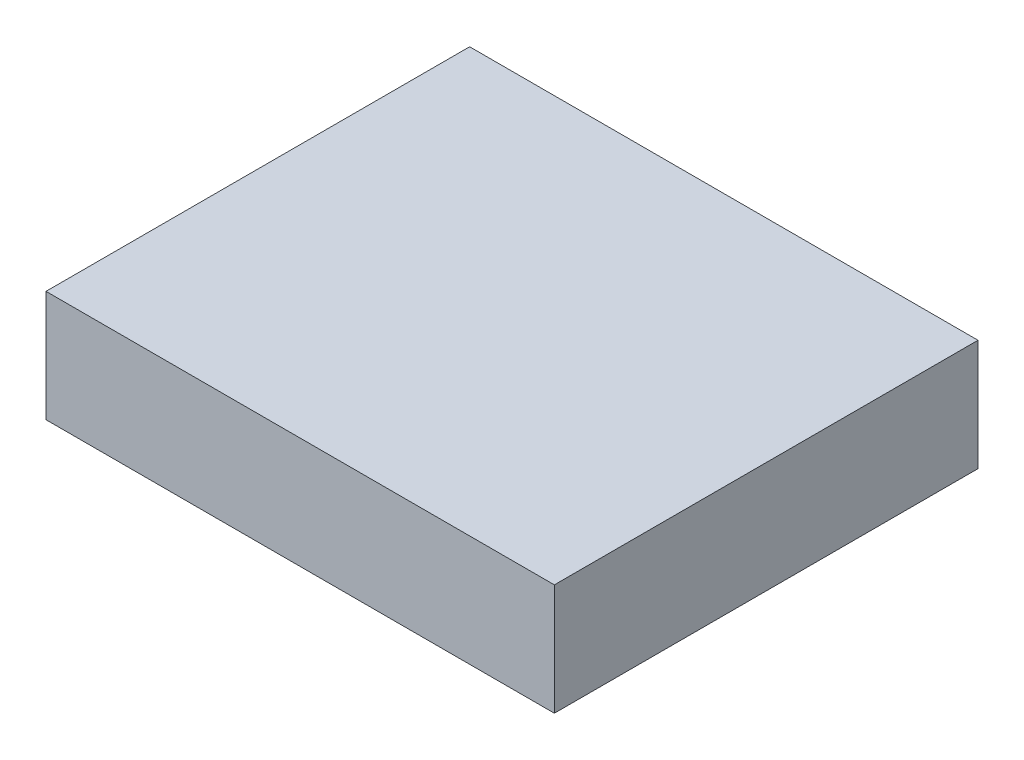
ISO-10303-21;
HEADER;
FILE_DESCRIPTION(('STEP AP214'),'2;1');
FILE_NAME('part.step','',(''),(''),'','','');
FILE_SCHEMA(('AUTOMOTIVE_DESIGN { 1 0 10303 214 1 1 1 1 }'));
ENDSEC;
DATA;
#1=APPLICATION_CONTEXT('core data for automotive mechanical design processes');
#2=APPLICATION_PROTOCOL_DEFINITION('international standard','automotive_design',2000,#1);
#3=PRODUCT_CONTEXT('',#1,'mechanical');
#4=PRODUCT('Part','Part','',(#3));
#5=PRODUCT_RELATED_PRODUCT_CATEGORY('part','',(#4));
#6=PRODUCT_DEFINITION_FORMATION('','',#4);
#7=PRODUCT_DEFINITION_CONTEXT('part definition',#1,'design');
#8=PRODUCT_DEFINITION('design','',#6,#7);
#9=PRODUCT_DEFINITION_SHAPE('','',#8);
#10=(LENGTH_UNIT() NAMED_UNIT(*) SI_UNIT(.MILLI.,.METRE.));
#11=(NAMED_UNIT(*) PLANE_ANGLE_UNIT() SI_UNIT($,.RADIAN.));
#12=(NAMED_UNIT(*) SI_UNIT($,.STERADIAN.) SOLID_ANGLE_UNIT());
#13=UNCERTAINTY_MEASURE_WITH_UNIT(LENGTH_MEASURE(1.E-05),#10,'distance_accuracy_value','');
#14=(GEOMETRIC_REPRESENTATION_CONTEXT(3) GLOBAL_UNCERTAINTY_ASSIGNED_CONTEXT((#13)) GLOBAL_UNIT_ASSIGNED_CONTEXT((#10,
#11,#12)) REPRESENTATION_CONTEXT('',''));
#15=CARTESIAN_POINT('',(0.,0.,0.));
#16=DIRECTION('',(0.,0.,1.));
#17=DIRECTION('',(1.,0.,0.));
#18=AXIS2_PLACEMENT_3D('',#15,#16,#17);
#19=CARTESIAN_POINT('',(-2.4,1.05,-2.));
#20=DIRECTION('',(1.,0.,0.));
#21=DIRECTION('',(0.,0.,-1.));
#22=AXIS2_PLACEMENT_3D('',#19,#20,#21);
#23=PLANE('',#22);
#24=DIRECTION('',(0.,0.,1.));
#25=VECTOR('',#24,1.);
#26=CARTESIAN_POINT('',(-2.4,0.,-2.));
#27=LINE('',#26,#25);
#28=CARTESIAN_POINT('',(-2.4,0.,-2.));
#29=VERTEX_POINT('',#28);
#30=CARTESIAN_POINT('',(-2.4,0.,2.));
#31=VERTEX_POINT('',#30);
#32=EDGE_CURVE('E95',#29,#31,#27,.T.);
#33=ORIENTED_EDGE('',*,*,#32,.T.);
#34=DIRECTION('',(0.,-1.,0.));
#35=VECTOR('',#34,1.);
#36=CARTESIAN_POINT('',(-2.4,1.05,2.));
#37=LINE('',#36,#35);
#38=CARTESIAN_POINT('',(-2.4,1.05,2.));
#39=VERTEX_POINT('',#38);
#40=EDGE_CURVE('E11',#39,#31,#37,.T.);
#41=ORIENTED_EDGE('',*,*,#40,.F.);
#42=DIRECTION('',(0.,0.,1.));
#43=VECTOR('',#42,1.);
#44=CARTESIAN_POINT('',(-2.4,1.05,-2.));
#45=LINE('',#44,#43);
#46=CARTESIAN_POINT('',(-2.4,1.05,-2.));
#47=VERTEX_POINT('',#46);
#48=EDGE_CURVE('E83',#47,#39,#45,.T.);
#49=ORIENTED_EDGE('',*,*,#48,.F.);
#50=DIRECTION('',(0.,-1.,0.));
#51=VECTOR('',#50,1.);
#52=CARTESIAN_POINT('',(-2.4,1.05,-2.));
#53=LINE('',#52,#51);
#54=EDGE_CURVE('E91',#47,#29,#53,.T.);
#55=ORIENTED_EDGE('',*,*,#54,.T.);
#56=EDGE_LOOP('',(#33,#41,#49,#55));
#57=FACE_BOUND('',#56,.T.);
#58=ADVANCED_FACE('F32',(#57),#23,.F.);
#59=CARTESIAN_POINT('',(2.4,1.05,2.));
#60=DIRECTION('',(0.,0.,-1.));
#61=DIRECTION('',(-1.,0.,0.));
#62=AXIS2_PLACEMENT_3D('',#59,#60,#61);
#63=PLANE('',#62);
#64=DIRECTION('',(1.,0.,0.));
#65=VECTOR('',#64,1.);
#66=CARTESIAN_POINT('',(2.4,0.,2.));
#67=LINE('',#66,#65);
#68=CARTESIAN_POINT('',(2.4,0.,2.));
#69=VERTEX_POINT('',#68);
#70=EDGE_CURVE('E87',#31,#69,#67,.T.);
#71=ORIENTED_EDGE('',*,*,#70,.T.);
#72=DIRECTION('',(0.,-1.,0.));
#73=VECTOR('',#72,1.);
#74=CARTESIAN_POINT('',(2.4,1.05,2.));
#75=LINE('',#74,#73);
#76=CARTESIAN_POINT('',(2.4,1.05,2.));
#77=VERTEX_POINT('',#76);
#78=EDGE_CURVE('E40',#77,#69,#75,.T.);
#79=ORIENTED_EDGE('',*,*,#78,.F.);
#80=DIRECTION('',(1.,0.,0.));
#81=VECTOR('',#80,1.);
#82=CARTESIAN_POINT('',(2.4,1.05,2.));
#83=LINE('',#82,#81);
#84=EDGE_CURVE('E78',#39,#77,#83,.T.);
#85=ORIENTED_EDGE('',*,*,#84,.F.);
#86=ORIENTED_EDGE('',*,*,#40,.T.);
#87=EDGE_LOOP('',(#71,#79,#85,#86));
#88=FACE_BOUND('',#87,.T.);
#89=ADVANCED_FACE('F86',(#88),#63,.F.);
#90=CARTESIAN_POINT('',(2.4,1.05,-2.));
#91=DIRECTION('',(-1.,0.,0.));
#92=DIRECTION('',(0.,0.,1.));
#93=AXIS2_PLACEMENT_3D('',#90,#91,#92);
#94=PLANE('',#93);
#95=DIRECTION('',(0.,0.,-1.));
#96=VECTOR('',#95,1.);
#97=CARTESIAN_POINT('',(2.4,0.,-2.));
#98=LINE('',#97,#96);
#99=CARTESIAN_POINT('',(2.4,0.,-2.));
#100=VERTEX_POINT('',#99);
#101=EDGE_CURVE('E65',#69,#100,#98,.T.);
#102=ORIENTED_EDGE('',*,*,#101,.T.);
#103=DIRECTION('',(0.,-1.,0.));
#104=VECTOR('',#103,1.);
#105=CARTESIAN_POINT('',(2.4,1.05,-2.));
#106=LINE('',#105,#104);
#107=CARTESIAN_POINT('',(2.4,1.05,-2.));
#108=VERTEX_POINT('',#107);
#109=EDGE_CURVE('E88',#108,#100,#106,.T.);
#110=ORIENTED_EDGE('',*,*,#109,.F.);
#111=DIRECTION('',(0.,0.,-1.));
#112=VECTOR('',#111,1.);
#113=CARTESIAN_POINT('',(2.4,1.05,-2.));
#114=LINE('',#113,#112);
#115=EDGE_CURVE('E81',#77,#108,#114,.T.);
#116=ORIENTED_EDGE('',*,*,#115,.F.);
#117=ORIENTED_EDGE('',*,*,#78,.T.);
#118=EDGE_LOOP('',(#102,#110,#116,#117));
#119=FACE_BOUND('',#118,.T.);
#120=ADVANCED_FACE('F89',(#119),#94,.F.);
#121=CARTESIAN_POINT('',(2.4,1.05,-2.));
#122=DIRECTION('',(0.,0.,1.));
#123=DIRECTION('',(1.,0.,0.));
#124=AXIS2_PLACEMENT_3D('',#121,#122,#123);
#125=PLANE('',#124);
#126=DIRECTION('',(-1.,0.,0.));
#127=VECTOR('',#126,1.);
#128=CARTESIAN_POINT('',(2.4,0.,-2.));
#129=LINE('',#128,#127);
#130=EDGE_CURVE('E71',#100,#29,#129,.T.);
#131=ORIENTED_EDGE('',*,*,#130,.T.);
#132=ORIENTED_EDGE('',*,*,#54,.F.);
#133=DIRECTION('',(-1.,0.,0.));
#134=VECTOR('',#133,1.);
#135=CARTESIAN_POINT('',(2.4,1.05,-2.));
#136=LINE('',#135,#134);
#137=EDGE_CURVE('E48',#108,#47,#136,.T.);
#138=ORIENTED_EDGE('',*,*,#137,.F.);
#139=ORIENTED_EDGE('',*,*,#109,.T.);
#140=EDGE_LOOP('',(#131,#132,#138,#139));
#141=FACE_BOUND('',#140,.T.);
#142=ADVANCED_FACE('F102',(#141),#125,.F.);
#143=CARTESIAN_POINT('',(0.,1.05,0.));
#144=DIRECTION('',(0.,-1.,0.));
#145=DIRECTION('',(0.,0.,-1.));
#146=AXIS2_PLACEMENT_3D('',#143,#144,#145);
#147=PLANE('',#146);
#148=ORIENTED_EDGE('',*,*,#48,.T.);
#149=ORIENTED_EDGE('',*,*,#84,.T.);
#150=ORIENTED_EDGE('',*,*,#115,.T.);
#151=ORIENTED_EDGE('',*,*,#137,.T.);
#152=EDGE_LOOP('',(#148,#149,#150,#151));
#153=FACE_BOUND('',#152,.T.);
#154=ADVANCED_FACE('F79',(#153),#147,.F.);
#155=CARTESIAN_POINT('',(0.,0.,0.));
#156=DIRECTION('',(0.,-1.,0.));
#157=DIRECTION('',(0.,0.,-1.));
#158=AXIS2_PLACEMENT_3D('',#155,#156,#157);
#159=PLANE('',#158);
#160=ORIENTED_EDGE('',*,*,#32,.F.);
#161=ORIENTED_EDGE('',*,*,#130,.F.);
#162=ORIENTED_EDGE('',*,*,#101,.F.);
#163=ORIENTED_EDGE('',*,*,#70,.F.);
#164=EDGE_LOOP('',(#160,#161,#162,#163));
#165=FACE_BOUND('',#164,.T.);
#166=ADVANCED_FACE('F105',(#165),#159,.T.);
#167=CLOSED_SHELL('',(#58,#89,#120,#142,#154,#166));
#168=MANIFOLD_SOLID_BREP('B2',#167);
#169=ADVANCED_BREP_SHAPE_REPRESENTATION('',(#18,#168),#14);
#170=SHAPE_DEFINITION_REPRESENTATION(#9,#169);
ENDSEC;
END-ISO-10303-21;
